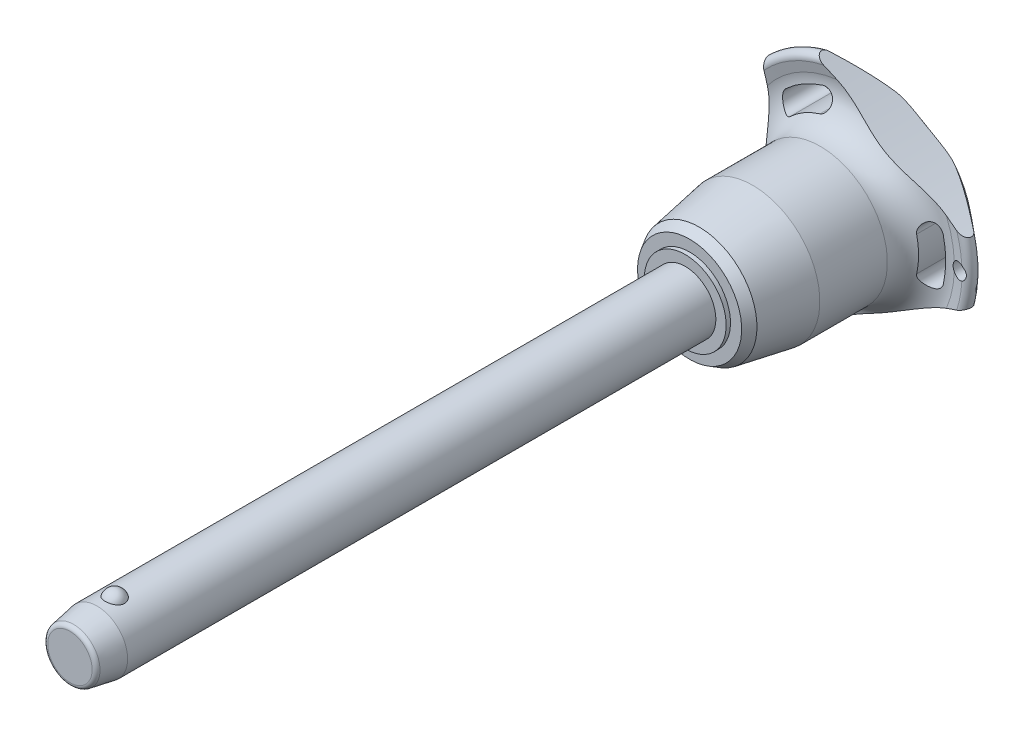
from build123d import *

# Parameters (mm, degrees)
SKETCH1_R           = 6
BOSS_EXTRUDE1_DEPTH = 110
SKETCH2_R           = 5.15
BOSS_EXTRUDE2_DEPTH = 39.7
BOSS_EXTRUDE3_START = 10.6
SKETCH1_2_R         = 6
BOSS_EXTRUDE3_DEPTH = 10.6
CHAMFER1_SIZE       = 5.3
CHAMFER1_SIZE2      = 0.934532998
FILLET1_R           = 0.85
SKETCH6_R           = 144.275
CUT_EXTRUDE1_DEPTH  = 154.440094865
CIRPATTERN1_COUNT   = 3
SKETCH7_R           = 1.5
CUT_EXTRUDE2_DEPTH  = 154.309245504


with BuildPart() as part:
    # Sketch1 → Boss-Extrude1 (new body)
    with BuildSketch(Plane.XY):
        Circle(SKETCH1_R)
    extrude(amount=-BOSS_EXTRUDE1_DEPTH)

    # Sketch2 → Boss-Extrude2 (add)
    with BuildSketch(Plane(origin=(0, 0, -110), x_dir=(-1, 0, 0), z_dir=(0, 0, -1))):
        Circle(SKETCH2_R)
    extrude(amount=BOSS_EXTRUDE2_DEPTH)

    # Sketch3 → Revolve1 (revolve)
    with BuildSketch(Plane(origin=(0, 0, 0), x_dir=(0, 0, -1), z_dir=(1, 0, 0))):
        with BuildLine():
            Line((-1.854049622, 7.25), (-1.854049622, 3.25))
            ThreePointArc((-1.854049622, 3.25), (0.145950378, 5.25), (-1.854049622, 7.25))
        make_face()
        with BuildLine():
            Line((-1.854049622, -3.25), (-1.854049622, -7.25))
            ThreePointArc((-1.854049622, -7.25), (0.145950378, -5.25), (-1.854049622, -3.25))
        make_face()
    revolve(axis=Axis((0, -3.25, 1.854049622), (0, 1, 0)))

    # Sketch1_2 → Boss-Extrude3 (add)
    with BuildSketch(Plane.XY.offset(BOSS_EXTRUDE3_START)):
        Circle(SKETCH1_2_R)
    extrude(amount=-BOSS_EXTRUDE3_DEPTH)

    # Chamfer1
    chamfer1_edges = [part.edges().sort_by_distance(p)[0] for p in [
        (-6, 0, 10.6),
    ]]
    chamfer1_side = [part.faces().sort_by_distance(p)[0] for p in [
        (-6, 0, -49.7),
    ]]
    chamfer(chamfer1_edges, length=CHAMFER1_SIZE, length2=CHAMFER1_SIZE2, reference=chamfer1_side[0])

    # Fillet1
    fillet1_edges = [part.edges().sort_by_distance(p)[0] for p in [
        (-5.065467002, 0, 10.6),
        (5.15, 0, -149.7),
    ]]
    fillet(fillet1_edges, radius=FILLET1_R)

    # Sketch4 → Revolve2 (revolve)
    with BuildSketch(Plane(origin=(0, 0, 0), x_dir=(0, 0, -1), z_dir=(1, 0, 0)), mode=Mode.PRIVATE) as revolve2_sk:
        Polygon((110, 0), (110, 8.017240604), (110.85, 8.017240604), (110.85, 10.206249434), (112.745737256, 11.300753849), (123.233333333, 13.15), (136.466666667, 13.15), (136.466666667, 0), align=None)
    revolve(revolve2_sk.sketch.rotate(Axis((0, 0, -136.466666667), (0, 0, 1)), 90), axis=Axis((0, 0, -136.466666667), (0, 0, 1)))

    # Sketch5 → Revolve3 (revolve)
    with BuildSketch(Plane(origin=(0, 0, 0), x_dir=(0, 0, -1), z_dir=(1, 0, 0)), mode=Mode.PRIVATE) as revolve3_sk:
        with BuildLine():
            Line((142.32877039, 20.428960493), (141.910912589, 22.344207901))
            ThreePointArc((141.910912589, 22.344207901), (142.554394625, 23.677136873), (144.002586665, 23.371345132))
            Line((144.002586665, 23.371345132), (149.141488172, 17.247040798))
            ThreePointArc((149.141488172, 17.247040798), (149.7, 15.584758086), (148.978803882, 13.986322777))
            ThreePointArc((148.978803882, 13.986322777), (144.617427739, 7.589034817), (143.083333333, 0))
            Line((143.083333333, 0), (136.466666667, 0))
            Line((136.466666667, 0), (136.466666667, 13.15))
            ThreePointArc((136.466666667, 13.15), (141.139661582, 15.38660811), (142.32877039, 20.428960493))
        make_face()
    revolve(revolve3_sk.sketch.rotate(Axis((0, 0, -143.083333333), (0, 0, 1)), 90), axis=Axis((0, 0, -143.083333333), (0, 0, 1)))

    # Sketch6 → Cut-Extrude1 (cut, through all)
    with BuildSketch(Plane.XY):
        with Locations((-159.975, 0)):
            Circle(SKETCH6_R)
        with BuildLine():
            ThreePointArc((18.131206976, -4.190753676), (18.60922037, 0), (18.131206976, 4.190753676))
            ThreePointArc((18.131206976, 4.190753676), (15.94840906, 5.553949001), (14.585213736, 3.371151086))
            ThreePointArc((14.585213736, 3.371151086), (14.969740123, 0), (14.585213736, -3.371151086))
            ThreePointArc((14.585213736, -3.371151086), (15.94840906, -5.553949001), (18.131206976, -4.190753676))
        make_face()
    cut_extrude1 = extrude(amount=-CUT_EXTRUDE1_DEPTH, mode=Mode.SUBTRACT)

    # CirPattern1: Cut-Extrude1 ×3 about axis
    cirpattern1_axis = Axis((0, 0, 0), (0, 0, 1))
    for i in range(1, CIRPATTERN1_COUNT):
        add(cut_extrude1.rotate(cirpattern1_axis, i * 360 / CIRPATTERN1_COUNT), mode=Mode.SUBTRACT)

    # Sketch7 → Cut-Extrude2 (cut, through all)
    with BuildSketch(Plane.XY):
        with Locations(Location((21.60922037, 0, 0), (0, 0, 297.620773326))):
            Circle(SKETCH7_R)
    extrude(amount=-CUT_EXTRUDE2_DEPTH, mode=Mode.SUBTRACT)


solid = part.part
